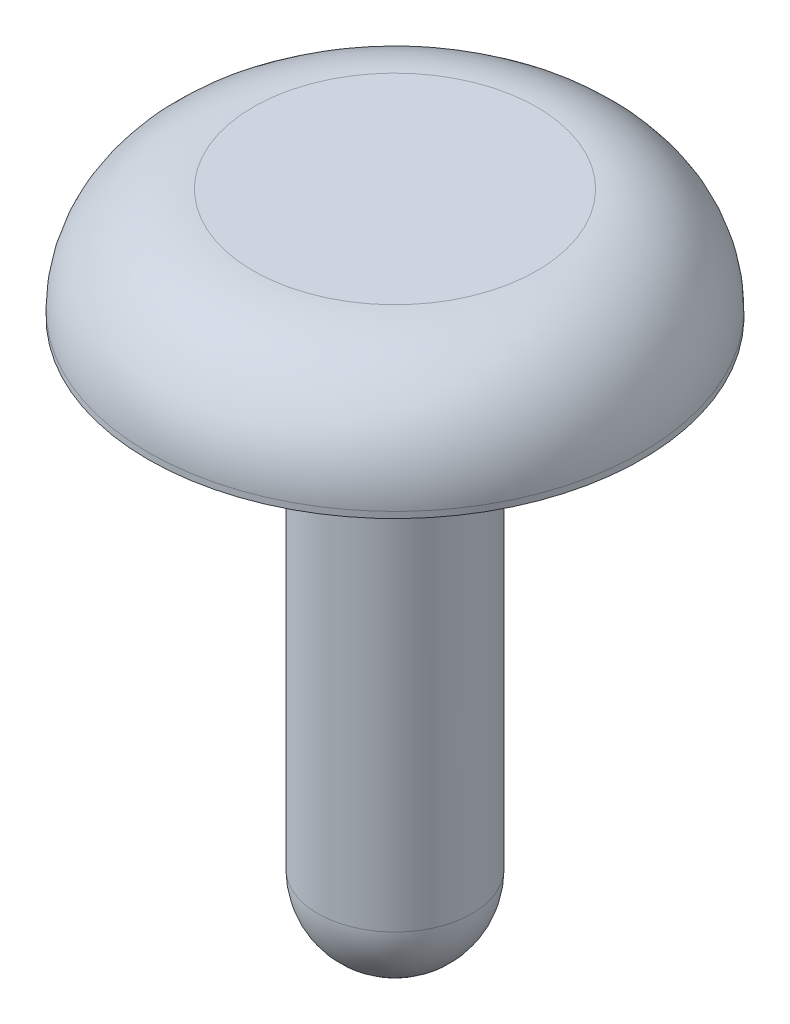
from build123d import *


with BuildPart() as part:
    # Esquisse1 → R_volution1 (revolve)
    with BuildSketch(Plane.XY, mode=Mode.PRIVATE) as r_volution1_sk:
        with BuildLine():
            Line((0, 0), (-2.3, 0))
            ThreePointArc((-2.3, 0), (-3.502081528, -0.497918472), (-4, -1.7))
            Line((-4, -1.7), (-4, -1.8))
            Line((-4, -1.8), (-3.327350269, -1.8))
            Line((-3.327350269, -1.8), (-2.75, -0.8))
            Line((-2.75, -0.8), (-1.25, -0.8))
            Line((-1.25, -0.8), (-1.25, -1.8))
            Line((-1.25, -1.8), (-1.25, -9.55))
            ThreePointArc((-1.25, -9.55), (-0.883883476, -10.433883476), (0, -10.8))
            Line((0, -10.8), (0, 0))
        make_face()
    revolve(r_volution1_sk.sketch.rotate(Axis((0, 0, 0), (0, -1, 0)), 270), axis=Axis((0, 0, 0), (0, -1, 0)))


solid = part.part
